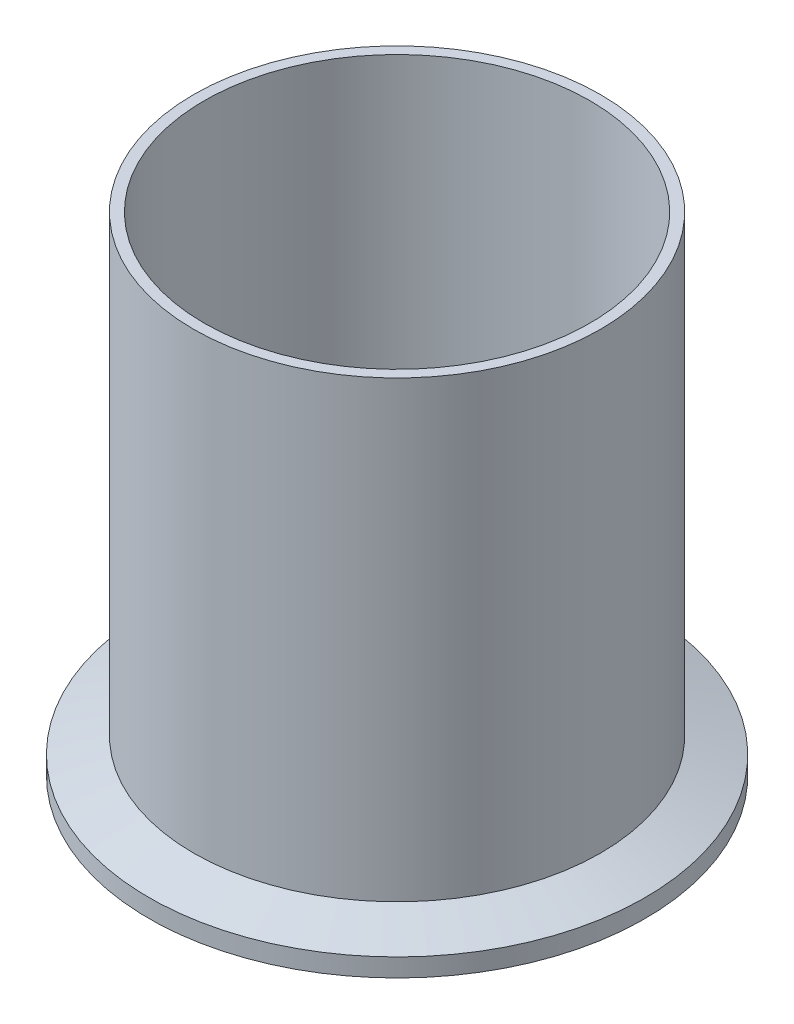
ISO-10303-21;
HEADER;
FILE_DESCRIPTION(('STEP AP214'),'2;1');
FILE_NAME('part.step','',(''),(''),'','','');
FILE_SCHEMA(('AUTOMOTIVE_DESIGN { 1 0 10303 214 1 1 1 1 }'));
ENDSEC;
DATA;
#1=APPLICATION_CONTEXT('core data for automotive mechanical design processes');
#2=APPLICATION_PROTOCOL_DEFINITION('international standard','automotive_design',2000,#1);
#3=PRODUCT_CONTEXT('',#1,'mechanical');
#4=PRODUCT('Part','Part','',(#3));
#5=PRODUCT_RELATED_PRODUCT_CATEGORY('part','',(#4));
#6=PRODUCT_DEFINITION_FORMATION('','',#4);
#7=PRODUCT_DEFINITION_CONTEXT('part definition',#1,'design');
#8=PRODUCT_DEFINITION('design','',#6,#7);
#9=PRODUCT_DEFINITION_SHAPE('','',#8);
#10=(LENGTH_UNIT() NAMED_UNIT(*) SI_UNIT(.MILLI.,.METRE.));
#11=(NAMED_UNIT(*) PLANE_ANGLE_UNIT() SI_UNIT($,.RADIAN.));
#12=(NAMED_UNIT(*) SI_UNIT($,.STERADIAN.) SOLID_ANGLE_UNIT());
#13=UNCERTAINTY_MEASURE_WITH_UNIT(LENGTH_MEASURE(1.E-05),#10,'distance_accuracy_value','');
#14=(GEOMETRIC_REPRESENTATION_CONTEXT(3) GLOBAL_UNCERTAINTY_ASSIGNED_CONTEXT((#13)) GLOBAL_UNIT_ASSIGNED_CONTEXT((#10,
#11,#12)) REPRESENTATION_CONTEXT('',''));
#15=CARTESIAN_POINT('',(0.,0.,0.));
#16=DIRECTION('',(0.,0.,1.));
#17=DIRECTION('',(1.,0.,0.));
#18=AXIS2_PLACEMENT_3D('',#15,#16,#17);
#19=CARTESIAN_POINT('',(0.,0.7874,0.));
#20=DIRECTION('',(0.,-1.,0.));
#21=DIRECTION('',(0.,0.,-1.));
#22=AXIS2_PLACEMENT_3D('',#19,#20,#21);
#23=TOROIDAL_SURFACE('',#22,37.1367084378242,0.787400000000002);
#24=CARTESIAN_POINT('',(0.,0.,0.));
#25=DIRECTION('',(0.,-1.,0.));
#26=DIRECTION('',(0.,0.,-1.));
#27=AXIS2_PLACEMENT_3D('',#24,#25,#26);
#28=CIRCLE('',#27,37.1367084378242);
#29=CARTESIAN_POINT('',(0.,0.,-37.1367084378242));
#30=VERTEX_POINT('',#29);
#31=EDGE_CURVE('E67',#30,#30,#28,.T.);
#32=ORIENTED_EDGE('',*,*,#31,.T.);
#33=EDGE_LOOP('',(#32));
#34=FACE_BOUND('',#33,.T.);
#35=CARTESIAN_POINT('',(0.,0.474458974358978,0.));
#36=DIRECTION('',(0.,-1.,0.));
#37=DIRECTION('',(0.,0.,-1.));
#38=AXIS2_PLACEMENT_3D('',#35,#36,#37);
#39=CIRCLE('',#38,36.4141666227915);
#40=CARTESIAN_POINT('',(0.,0.474458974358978,-36.4141666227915));
#41=VERTEX_POINT('',#40);
#42=EDGE_CURVE('E10',#41,#41,#39,.T.);
#43=ORIENTED_EDGE('',*,*,#42,.F.);
#44=EDGE_LOOP('',(#43));
#45=FACE_BOUND('',#44,.T.);
#46=ADVANCED_FACE('F33',(#34,#45),#23,.T.);
#47=CARTESIAN_POINT('',(0.,0.,0.));
#48=DIRECTION('',(0.,-1.,0.));
#49=DIRECTION('',(0.,0.,-1.));
#50=AXIS2_PLACEMENT_3D('',#47,#48,#49);
#51=TOROIDAL_SURFACE('',#50,35.3187,1.1938);
#52=CARTESIAN_POINT('',(0.,0.474458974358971,0.));
#53=DIRECTION('',(0.,-1.,0.));
#54=DIRECTION('',(0.,0.,-1.));
#55=AXIS2_PLACEMENT_3D('',#52,#53,#54);
#56=CIRCLE('',#55,34.2232333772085);
#57=CARTESIAN_POINT('',(0.,0.474458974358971,-34.2232333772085));
#58=VERTEX_POINT('',#57);
#59=EDGE_CURVE('E39',#58,#58,#56,.T.);
#60=ORIENTED_EDGE('',*,*,#59,.F.);
#61=EDGE_LOOP('',(#60));
#62=FACE_BOUND('',#61,.T.);
#63=ORIENTED_EDGE('',*,*,#42,.T.);
#64=EDGE_LOOP('',(#63));
#65=FACE_BOUND('',#64,.T.);
#66=ADVANCED_FACE('F115',(#62,#65),#51,.F.);
#67=CARTESIAN_POINT('',(0.,0.7874,0.));
#68=DIRECTION('',(0.,-1.,0.));
#69=DIRECTION('',(0.,0.,-1.));
#70=AXIS2_PLACEMENT_3D('',#67,#68,#69);
#71=TOROIDAL_SURFACE('',#70,33.5006915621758,0.787399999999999);
#72=ORIENTED_EDGE('',*,*,#59,.T.);
#73=EDGE_LOOP('',(#72));
#74=FACE_BOUND('',#73,.T.);
#75=CARTESIAN_POINT('',(0.,0.,0.));
#76=DIRECTION('',(0.,-1.,0.));
#77=DIRECTION('',(0.,0.,-1.));
#78=AXIS2_PLACEMENT_3D('',#75,#76,#77);
#79=CIRCLE('',#78,33.5006915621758);
#80=CARTESIAN_POINT('',(0.,0.,-33.5006915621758));
#81=VERTEX_POINT('',#80);
#82=EDGE_CURVE('E43',#81,#81,#79,.T.);
#83=ORIENTED_EDGE('',*,*,#82,.F.);
#84=EDGE_LOOP('',(#83));
#85=FACE_BOUND('',#84,.T.);
#86=ADVANCED_FACE('F111',(#74,#85),#71,.T.);
#87=CARTESIAN_POINT('',(0.,0.,0.));
#88=DIRECTION('',(0.,1.,0.));
#89=DIRECTION('',(0.,0.,1.));
#90=AXIS2_PLACEMENT_3D('',#87,#88,#89);
#91=PLANE('',#90);
#92=CARTESIAN_POINT('',(0.,0.,0.));
#93=DIRECTION('',(0.,-1.,0.));
#94=DIRECTION('',(0.,0.,-1.));
#95=AXIS2_PLACEMENT_3D('',#92,#93,#94);
#96=CIRCLE('',#95,30.099);
#97=CARTESIAN_POINT('',(0.,0.,-30.099));
#98=VERTEX_POINT('',#97);
#99=EDGE_CURVE('E47',#98,#98,#96,.T.);
#100=ORIENTED_EDGE('',*,*,#99,.F.);
#101=EDGE_LOOP('',(#100));
#102=FACE_BOUND('',#101,.T.);
#103=ORIENTED_EDGE('',*,*,#82,.T.);
#104=EDGE_LOOP('',(#103));
#105=FACE_BOUND('',#104,.T.);
#106=ADVANCED_FACE('F105',(#102,#105),#91,.F.);
#107=CARTESIAN_POINT('',(0.,0.,0.));
#108=DIRECTION('',(0.,-1.,0.));
#109=DIRECTION('',(0.,0.,-1.));
#110=AXIS2_PLACEMENT_3D('',#107,#108,#109);
#111=CYLINDRICAL_SURFACE('',#110,30.099);
#112=ORIENTED_EDGE('',*,*,#99,.T.);
#113=EDGE_LOOP('',(#112));
#114=FACE_BOUND('',#113,.T.);
#115=CARTESIAN_POINT('',(0.,76.2,0.));
#116=DIRECTION('',(0.,-1.,0.));
#117=DIRECTION('',(0.,0.,-1.));
#118=AXIS2_PLACEMENT_3D('',#115,#116,#117);
#119=CIRCLE('',#118,30.099);
#120=CARTESIAN_POINT('',(0.,76.2,-30.099));
#121=VERTEX_POINT('',#120);
#122=EDGE_CURVE('E52',#121,#121,#119,.T.);
#123=ORIENTED_EDGE('',*,*,#122,.F.);
#124=EDGE_LOOP('',(#123));
#125=FACE_BOUND('',#124,.T.);
#126=ADVANCED_FACE('F100',(#114,#125),#111,.F.);
#127=CARTESIAN_POINT('',(0.,76.2,0.));
#128=DIRECTION('',(0.,-1.,0.));
#129=DIRECTION('',(0.,0.,-1.));
#130=AXIS2_PLACEMENT_3D('',#127,#128,#129);
#131=PLANE('',#130);
#132=CARTESIAN_POINT('',(0.,76.2,0.));
#133=DIRECTION('',(0.,-1.,0.));
#134=DIRECTION('',(0.,0.,-1.));
#135=AXIS2_PLACEMENT_3D('',#132,#133,#134);
#136=CIRCLE('',#135,31.75);
#137=CARTESIAN_POINT('',(0.,76.2,-31.75));
#138=VERTEX_POINT('',#137);
#139=EDGE_CURVE('E55',#138,#138,#136,.T.);
#140=ORIENTED_EDGE('',*,*,#139,.F.);
#141=EDGE_LOOP('',(#140));
#142=FACE_BOUND('',#141,.T.);
#143=ORIENTED_EDGE('',*,*,#122,.T.);
#144=EDGE_LOOP('',(#143));
#145=FACE_BOUND('',#144,.T.);
#146=ADVANCED_FACE('F94',(#142,#145),#131,.F.);
#147=CARTESIAN_POINT('',(0.,0.,0.));
#148=DIRECTION('',(0.,-1.,0.));
#149=DIRECTION('',(0.,0.,-1.));
#150=AXIS2_PLACEMENT_3D('',#147,#148,#149);
#151=CYLINDRICAL_SURFACE('',#150,31.75);
#152=CARTESIAN_POINT('',(0.,5.37788724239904,0.));
#153=DIRECTION('',(0.,-1.,0.));
#154=DIRECTION('',(0.,0.,-1.));
#155=AXIS2_PLACEMENT_3D('',#152,#153,#154);
#156=CIRCLE('',#155,31.75);
#157=CARTESIAN_POINT('',(0.,5.37788724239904,-31.75));
#158=VERTEX_POINT('',#157);
#159=EDGE_CURVE('E58',#158,#158,#156,.T.);
#160=ORIENTED_EDGE('',*,*,#159,.F.);
#161=EDGE_LOOP('',(#160));
#162=FACE_BOUND('',#161,.T.);
#163=ORIENTED_EDGE('',*,*,#139,.T.);
#164=EDGE_LOOP('',(#163));
#165=FACE_BOUND('',#164,.T.);
#166=ADVANCED_FACE('F88',(#162,#165),#151,.T.);
#167=CARTESIAN_POINT('',(0.,5.37788724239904,0.));
#168=DIRECTION('',(0.,-1.,0.));
#169=DIRECTION('',(0.,0.,-1.));
#170=AXIS2_PLACEMENT_3D('',#167,#168,#169);
#171=CONICAL_SURFACE('',#170,31.75,1.22173047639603);
#172=CARTESIAN_POINT('',(0.,2.8448,0.));
#173=DIRECTION('',(0.,-1.,0.));
#174=DIRECTION('',(0.,0.,-1.));
#175=AXIS2_PLACEMENT_3D('',#172,#173,#174);
#176=CIRCLE('',#175,38.7096);
#177=CARTESIAN_POINT('',(0.,2.8448,-38.7096));
#178=VERTEX_POINT('',#177);
#179=EDGE_CURVE('E61',#178,#178,#176,.T.);
#180=ORIENTED_EDGE('',*,*,#179,.F.);
#181=EDGE_LOOP('',(#180));
#182=FACE_BOUND('',#181,.T.);
#183=ORIENTED_EDGE('',*,*,#159,.T.);
#184=EDGE_LOOP('',(#183));
#185=FACE_BOUND('',#184,.T.);
#186=ADVANCED_FACE('F82',(#182,#185),#171,.T.);
#187=CARTESIAN_POINT('',(0.,0.,0.));
#188=DIRECTION('',(0.,-1.,0.));
#189=DIRECTION('',(0.,0.,-1.));
#190=AXIS2_PLACEMENT_3D('',#187,#188,#189);
#191=CYLINDRICAL_SURFACE('',#190,38.7096);
#192=CARTESIAN_POINT('',(0.,0.,0.));
#193=DIRECTION('',(0.,-1.,0.));
#194=DIRECTION('',(0.,0.,-1.));
#195=AXIS2_PLACEMENT_3D('',#192,#193,#194);
#196=CIRCLE('',#195,38.7096);
#197=CARTESIAN_POINT('',(0.,0.,-38.7096));
#198=VERTEX_POINT('',#197);
#199=EDGE_CURVE('E64',#198,#198,#196,.T.);
#200=ORIENTED_EDGE('',*,*,#199,.F.);
#201=EDGE_LOOP('',(#200));
#202=FACE_BOUND('',#201,.T.);
#203=ORIENTED_EDGE('',*,*,#179,.T.);
#204=EDGE_LOOP('',(#203));
#205=FACE_BOUND('',#204,.T.);
#206=ADVANCED_FACE('F76',(#202,#205),#191,.T.);
#207=CARTESIAN_POINT('',(0.,0.,0.));
#208=DIRECTION('',(0.,1.,0.));
#209=DIRECTION('',(0.,0.,1.));
#210=AXIS2_PLACEMENT_3D('',#207,#208,#209);
#211=PLANE('',#210);
#212=ORIENTED_EDGE('',*,*,#31,.F.);
#213=EDGE_LOOP('',(#212));
#214=FACE_BOUND('',#213,.T.);
#215=ORIENTED_EDGE('',*,*,#199,.T.);
#216=EDGE_LOOP('',(#215));
#217=FACE_BOUND('',#216,.T.);
#218=ADVANCED_FACE('F73',(#214,#217),#211,.F.);
#219=CLOSED_SHELL('',(#46,#66,#86,#106,#126,#146,#166,#186,#206,#218));
#220=MANIFOLD_SOLID_BREP('B2',#219);
#221=ADVANCED_BREP_SHAPE_REPRESENTATION('',(#18,#220),#14);
#222=SHAPE_DEFINITION_REPRESENTATION(#9,#221);
ENDSEC;
END-ISO-10303-21;
